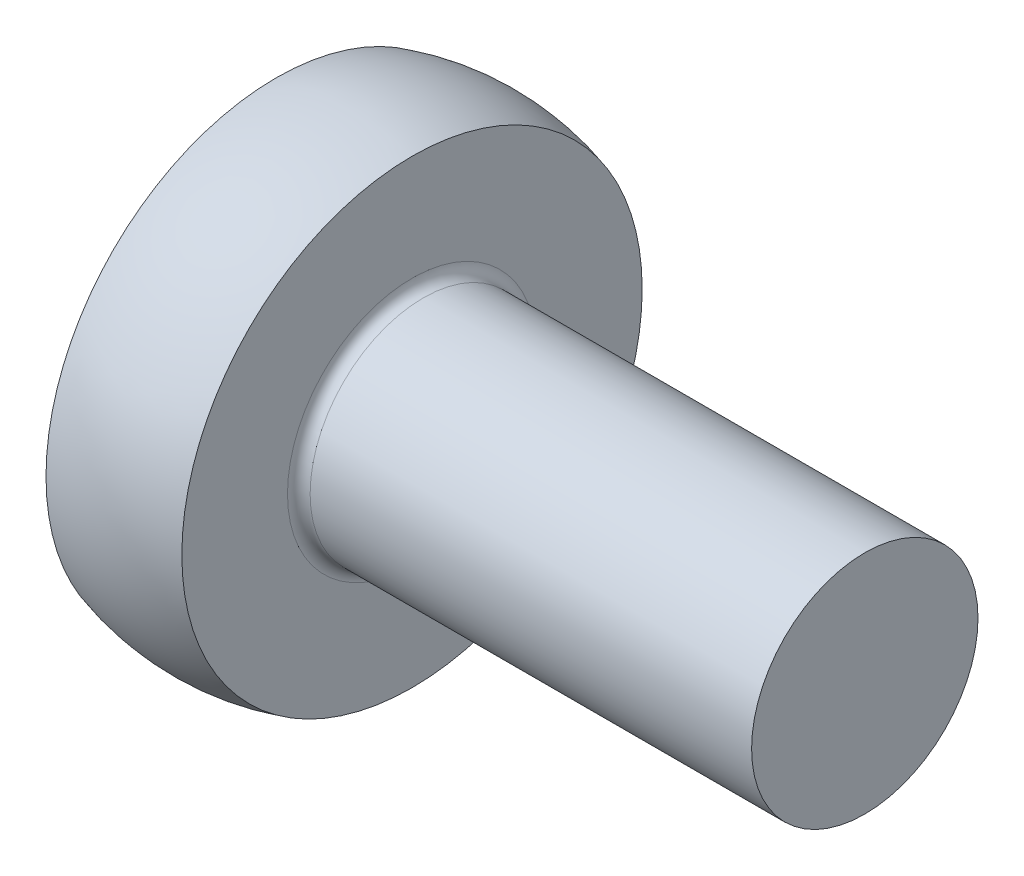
ISO-10303-21;
HEADER;
FILE_DESCRIPTION(('STEP AP214'),'2;1');
FILE_NAME('part.step','',(''),(''),'','','');
FILE_SCHEMA(('AUTOMOTIVE_DESIGN { 1 0 10303 214 1 1 1 1 }'));
ENDSEC;
DATA;
#1=APPLICATION_CONTEXT('core data for automotive mechanical design processes');
#2=APPLICATION_PROTOCOL_DEFINITION('international standard','automotive_design',2000,#1);
#3=PRODUCT_CONTEXT('',#1,'mechanical');
#4=PRODUCT('Part','Part','',(#3));
#5=PRODUCT_RELATED_PRODUCT_CATEGORY('part','',(#4));
#6=PRODUCT_DEFINITION_FORMATION('','',#4);
#7=PRODUCT_DEFINITION_CONTEXT('part definition',#1,'design');
#8=PRODUCT_DEFINITION('design','',#6,#7);
#9=PRODUCT_DEFINITION_SHAPE('','',#8);
#10=(LENGTH_UNIT() NAMED_UNIT(*) SI_UNIT(.MILLI.,.METRE.));
#11=(NAMED_UNIT(*) PLANE_ANGLE_UNIT() SI_UNIT($,.RADIAN.));
#12=(NAMED_UNIT(*) SI_UNIT($,.STERADIAN.) SOLID_ANGLE_UNIT());
#13=UNCERTAINTY_MEASURE_WITH_UNIT(LENGTH_MEASURE(1.E-05),#10,'distance_accuracy_value','');
#14=(GEOMETRIC_REPRESENTATION_CONTEXT(3) GLOBAL_UNCERTAINTY_ASSIGNED_CONTEXT((#13)) GLOBAL_UNIT_ASSIGNED_CONTEXT((#10,
#11,#12)) REPRESENTATION_CONTEXT('',''));
#15=CARTESIAN_POINT('',(0.,0.,0.));
#16=DIRECTION('',(0.,0.,1.));
#17=DIRECTION('',(1.,0.,0.));
#18=AXIS2_PLACEMENT_3D('',#15,#16,#17);
#19=CARTESIAN_POINT('',(5.2,0.,0.));
#20=DIRECTION('',(-1.,0.,0.));
#21=DIRECTION('',(0.,0.,1.));
#22=AXIS2_PLACEMENT_3D('',#19,#20,#21);
#23=PLANE('',#22);
#24=CARTESIAN_POINT('',(5.2,0.,0.));
#25=DIRECTION('',(-1.,0.,0.));
#26=DIRECTION('',(0.,0.,1.));
#27=AXIS2_PLACEMENT_3D('',#24,#25,#26);
#28=CIRCLE('',#27,1.);
#29=CARTESIAN_POINT('',(5.2,0.,1.));
#30=VERTEX_POINT('',#29);
#31=EDGE_CURVE('E48',#30,#30,#28,.T.);
#32=ORIENTED_EDGE('',*,*,#31,.F.);
#33=EDGE_LOOP('',(#32));
#34=FACE_BOUND('',#33,.T.);
#35=ADVANCED_FACE('F40',(#34),#23,.F.);
#36=CARTESIAN_POINT('',(-2.31825396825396,0.,0.));
#37=DIRECTION('',(-1.,0.,0.));
#38=DIRECTION('',(0.,0.,1.));
#39=AXIS2_PLACEMENT_3D('',#36,#37,#38);
#40=CYLINDRICAL_SURFACE('',#39,1.);
#41=CARTESIAN_POINT('',(1.3,0.,0.));
#42=DIRECTION('',(-1.,0.,0.));
#43=DIRECTION('',(0.,0.,1.));
#44=AXIS2_PLACEMENT_3D('',#41,#42,#43);
#45=CIRCLE('',#44,1.);
#46=CARTESIAN_POINT('',(1.3,0.,1.));
#47=VERTEX_POINT('',#46);
#48=EDGE_CURVE('E10',#47,#47,#45,.F.);
#49=ORIENTED_EDGE('',*,*,#48,.T.);
#50=EDGE_LOOP('',(#49));
#51=FACE_BOUND('',#50,.T.);
#52=ORIENTED_EDGE('',*,*,#31,.T.);
#53=EDGE_LOOP('',(#52));
#54=FACE_BOUND('',#53,.T.);
#55=ADVANCED_FACE('F73',(#51,#54),#40,.T.);
#56=CARTESIAN_POINT('',(1.2,2.03332240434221,0.));
#57=DIRECTION('',(-1.,0.,0.));
#58=DIRECTION('',(0.,0.,1.));
#59=AXIS2_PLACEMENT_3D('',#56,#57,#58);
#60=PLANE('',#59);
#61=CARTESIAN_POINT('',(1.2,0.,0.));
#62=DIRECTION('',(-1.,0.,0.));
#63=DIRECTION('',(0.,0.,1.));
#64=AXIS2_PLACEMENT_3D('',#61,#62,#63);
#65=CIRCLE('',#64,1.1);
#66=CARTESIAN_POINT('',(1.2,0.,1.1));
#67=VERTEX_POINT('',#66);
#68=EDGE_CURVE('E42',#67,#67,#65,.T.);
#69=ORIENTED_EDGE('',*,*,#68,.T.);
#70=EDGE_LOOP('',(#69));
#71=FACE_BOUND('',#70,.T.);
#72=CARTESIAN_POINT('',(1.2,0.,0.));
#73=DIRECTION('',(-1.,0.,0.));
#74=DIRECTION('',(0.,0.,1.));
#75=AXIS2_PLACEMENT_3D('',#72,#73,#74);
#76=CIRCLE('',#75,2.03332240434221);
#77=CARTESIAN_POINT('',(1.2,2.03332240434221,0.));
#78=VERTEX_POINT('',#77);
#79=EDGE_CURVE('E55',#78,#78,#76,.T.);
#80=ORIENTED_EDGE('',*,*,#79,.F.);
#81=EDGE_LOOP('',(#80));
#82=FACE_BOUND('',#81,.T.);
#83=ADVANCED_FACE('F66',(#71,#82),#60,.F.);
#84=CARTESIAN_POINT('',(0.6,0.,0.));
#85=DIRECTION('',(-1.,0.,0.));
#86=DIRECTION('',(0.,1.,0.));
#87=AXIS2_PLACEMENT_3D('',#84,#85,#86);
#88=SPHERICAL_SURFACE('',#87,2.12);
#89=CARTESIAN_POINT('',(0.,0.,0.));
#90=DIRECTION('',(-1.,0.,0.));
#91=DIRECTION('',(0.,0.,1.));
#92=AXIS2_PLACEMENT_3D('',#89,#90,#91);
#93=CIRCLE('',#92,2.03332240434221);
#94=CARTESIAN_POINT('',(0.,2.03332240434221,0.));
#95=VERTEX_POINT('',#94);
#96=EDGE_CURVE('E60',#95,#95,#93,.T.);
#97=CARTESIAN_POINT('',(0.,2.03332240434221,0.));
#98=CARTESIAN_POINT('',(0.0121550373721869,2.03690916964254,0.));
#99=CARTESIAN_POINT('',(0.0243422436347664,2.04038691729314,0.));
#100=CARTESIAN_POINT('',(0.0487770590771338,2.04712331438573,0.));
#101=CARTESIAN_POINT('',(0.0610246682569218,2.05038196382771,0.));
#102=CARTESIAN_POINT('',(0.085576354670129,2.05667910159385,0.));
#103=CARTESIAN_POINT('',(0.0978804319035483,2.05971758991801,0.));
#104=CARTESIAN_POINT('',(0.12254109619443,2.0655734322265,0.));
#105=CARTESIAN_POINT('',(0.134897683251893,2.06839078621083,0.));
#106=CARTESIAN_POINT('',(0.159659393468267,2.07380345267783,0.));
#107=CARTESIAN_POINT('',(0.172064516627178,2.0763987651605,0.));
#108=CARTESIAN_POINT('',(0.196919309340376,2.08136651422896,0.));
#109=CARTESIAN_POINT('',(0.209368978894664,2.08373895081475,0.));
#110=CARTESIAN_POINT('',(0.234308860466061,2.08826018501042,0.));
#111=CARTESIAN_POINT('',(0.246799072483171,2.09040898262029,0.));
#112=CARTESIAN_POINT('',(0.271816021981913,2.09448224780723,0.));
#113=CARTESIAN_POINT('',(0.284342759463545,2.09640671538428,0.));
#114=CARTESIAN_POINT('',(0.309428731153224,2.10003070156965,0.));
#115=CARTESIAN_POINT('',(0.32198796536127,2.10173022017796,0.));
#116=CARTESIAN_POINT('',(0.347134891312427,2.10490376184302,0.));
#117=CARTESIAN_POINT('',(0.359722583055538,2.10637778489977,0.));
#118=CARTESIAN_POINT('',(0.38492237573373,2.10909986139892,0.));
#119=CARTESIAN_POINT('',(0.397534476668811,2.11034791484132,0.));
#120=CARTESIAN_POINT('',(0.422779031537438,2.11261765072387,0.));
#121=CARTESIAN_POINT('',(0.435411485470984,2.11363933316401,0.));
#122=CARTESIAN_POINT('',(0.460692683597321,2.11545599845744,0.));
#123=CARTESIAN_POINT('',(0.473341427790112,2.11625098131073,0.));
#124=CARTESIAN_POINT('',(0.498651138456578,2.11761399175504,0.));
#125=CARTESIAN_POINT('',(0.511312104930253,2.11818201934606,0.));
#126=CARTESIAN_POINT('',(0.536642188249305,2.11909093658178,0.));
#127=CARTESIAN_POINT('',(0.549311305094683,2.11943182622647,0.));
#128=CARTESIAN_POINT('',(0.574653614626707,2.11988635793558,0.));
#129=CARTESIAN_POINT('',(0.587326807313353,2.12,0.));
#130=CARTESIAN_POINT('',(0.612673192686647,2.12,0.));
#131=CARTESIAN_POINT('',(0.625346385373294,2.11988635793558,0.));
#132=CARTESIAN_POINT('',(0.650688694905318,2.11943182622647,0.));
#133=CARTESIAN_POINT('',(0.663357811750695,2.11909093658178,0.));
#134=CARTESIAN_POINT('',(0.688687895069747,2.11818201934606,0.));
#135=CARTESIAN_POINT('',(0.701348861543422,2.11761399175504,0.));
#136=CARTESIAN_POINT('',(0.726658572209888,2.11625098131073,0.));
#137=CARTESIAN_POINT('',(0.739307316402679,2.11545599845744,0.));
#138=CARTESIAN_POINT('',(0.764588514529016,2.11363933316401,0.));
#139=CARTESIAN_POINT('',(0.777220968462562,2.11261765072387,0.));
#140=CARTESIAN_POINT('',(0.802465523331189,2.11034791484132,0.));
#141=CARTESIAN_POINT('',(0.81507762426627,2.10909986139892,0.));
#142=CARTESIAN_POINT('',(0.840277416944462,2.10637778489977,0.));
#143=CARTESIAN_POINT('',(0.852865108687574,2.10490376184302,0.));
#144=CARTESIAN_POINT('',(0.878012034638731,2.10173022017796,0.));
#145=CARTESIAN_POINT('',(0.890571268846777,2.10003070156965,0.));
#146=CARTESIAN_POINT('',(0.915657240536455,2.09640671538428,0.));
#147=CARTESIAN_POINT('',(0.928183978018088,2.09448224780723,0.));
#148=CARTESIAN_POINT('',(0.953200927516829,2.09040898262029,0.));
#149=CARTESIAN_POINT('',(0.965691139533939,2.08826018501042,0.));
#150=CARTESIAN_POINT('',(0.990631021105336,2.08373895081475,0.));
#151=CARTESIAN_POINT('',(1.00308069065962,2.08136651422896,0.));
#152=CARTESIAN_POINT('',(1.02793548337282,2.0763987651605,0.));
#153=CARTESIAN_POINT('',(1.04034060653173,2.07380345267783,0.));
#154=CARTESIAN_POINT('',(1.06510231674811,2.06839078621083,0.));
#155=CARTESIAN_POINT('',(1.07745890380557,2.0655734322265,0.));
#156=CARTESIAN_POINT('',(1.10211956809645,2.05971758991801,0.));
#157=CARTESIAN_POINT('',(1.11442364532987,2.05667910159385,0.));
#158=CARTESIAN_POINT('',(1.13897533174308,2.05038196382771,0.));
#159=CARTESIAN_POINT('',(1.15122294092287,2.04712331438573,0.));
#160=CARTESIAN_POINT('',(1.17565775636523,2.04038691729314,0.));
#161=CARTESIAN_POINT('',(1.18784496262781,2.03690916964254,0.));
#162=CARTESIAN_POINT('',(1.2,2.03332240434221,0.));
#163=B_SPLINE_CURVE_WITH_KNOTS('',3,(#97,#98,#99,#100,#101,#102,#103,#104,#105,#106,#107,#108,
#109,#110,#111,#112,#113,#114,#115,#116,#117,#118,#119,#120,#121,#122,#123,#124,#125,#126,#127,
#128,#129,#130,#131,#132,#133,#134,#135,#136,#137,#138,#139,#140,#141,#142,#143,#144,#145,#146,
#147,#148,#149,#150,#151,#152,#153,#154,#155,#156,#157,#158,#159,#160,#161,#162),.UNSPECIFIED.,
.F.,.F.,(4,2,2,2,2,2,2,2,2,2,2,2,2,2,2,2,2,2,2,2,2,2,2,2,2,2,2,2,2,2,2,2,4),(0.,
0.0380190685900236,0.0760381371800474,0.114057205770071,0.152076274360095,0.190095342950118,
0.228114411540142,0.266133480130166,0.30415254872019,0.342171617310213,0.380190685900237,
0.418209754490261,0.456228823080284,0.494247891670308,0.532266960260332,0.570286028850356,
0.608305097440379,0.646324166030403,0.684343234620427,0.72236230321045,0.760381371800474,
0.798400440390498,0.836419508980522,0.874438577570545,0.912457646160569,0.950476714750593,
0.988495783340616,1.02651485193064,1.06453392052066,1.10255298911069,1.14057205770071,
1.17859112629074,1.21661019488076),.UNSPECIFIED.);
#164=EDGE_CURVE('BSEAM62',#95,#78,#163,.T.);
#165=ORIENTED_EDGE('',*,*,#96,.F.);
#166=ORIENTED_EDGE('',*,*,#79,.T.);
#167=ORIENTED_EDGE('',*,*,#164,.T.);
#168=ORIENTED_EDGE('',*,*,#164,.F.);
#169=EDGE_LOOP('',(#165,#167,#166,#168));
#170=FACE_BOUND('',#169,.T.);
#171=ADVANCED_FACE('F62',(#170),#88,.T.);
#172=CARTESIAN_POINT('',(0.,2.03332240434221,0.));
#173=DIRECTION('',(1.,0.,0.));
#174=DIRECTION('',(0.,0.,-1.));
#175=AXIS2_PLACEMENT_3D('',#172,#173,#174);
#176=PLANE('',#175);
#177=ORIENTED_EDGE('',*,*,#96,.T.);
#178=EDGE_LOOP('',(#177));
#179=FACE_BOUND('',#178,.T.);
#180=ADVANCED_FACE('F61',(#179),#176,.F.);
#181=CARTESIAN_POINT('',(1.3,0.,0.));
#182=DIRECTION('',(-1.,0.,0.));
#183=DIRECTION('',(0.,0.,1.));
#184=AXIS2_PLACEMENT_3D('',#181,#182,#183);
#185=TOROIDAL_SURFACE('',#184,1.1,0.1);
#186=ORIENTED_EDGE('',*,*,#48,.F.);
#187=EDGE_LOOP('',(#186));
#188=FACE_BOUND('',#187,.T.);
#189=ORIENTED_EDGE('',*,*,#68,.F.);
#190=EDGE_LOOP('',(#189));
#191=FACE_BOUND('',#190,.T.);
#192=ADVANCED_FACE('F39',(#188,#191),#185,.F.);
#193=CLOSED_SHELL('',(#35,#55,#83,#171,#180,#192));
#194=MANIFOLD_SOLID_BREP('B2',#193);
#195=ADVANCED_BREP_SHAPE_REPRESENTATION('',(#18,#194),#14);
#196=SHAPE_DEFINITION_REPRESENTATION(#9,#195);
ENDSEC;
END-ISO-10303-21;
